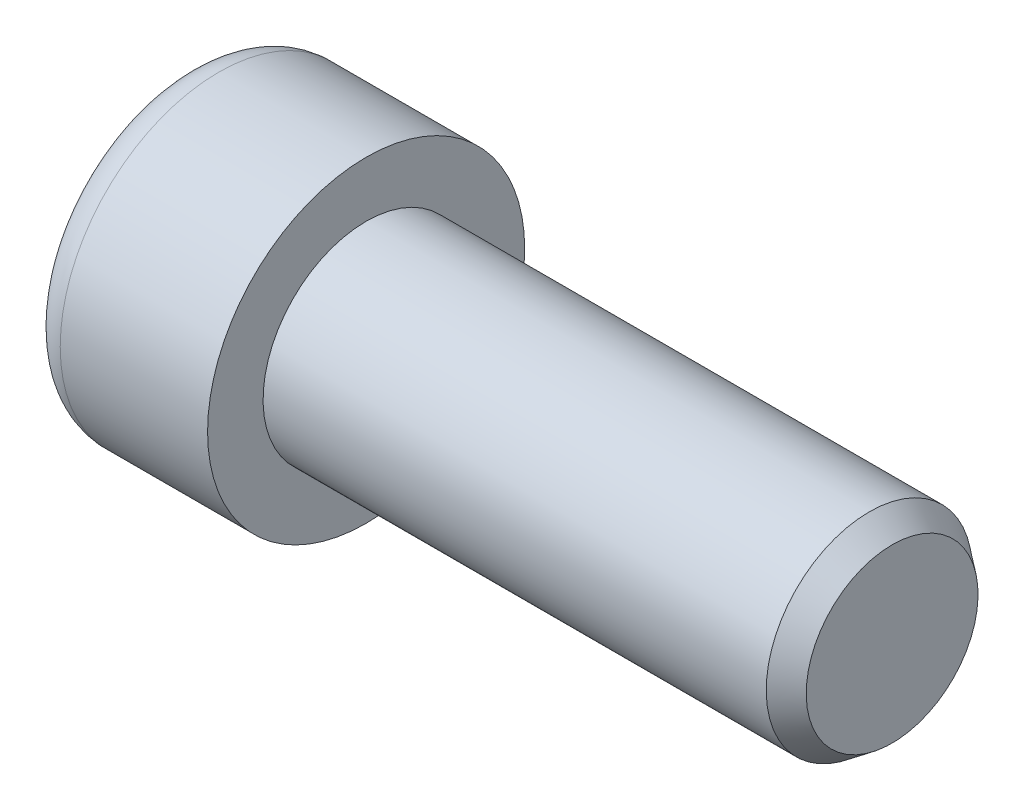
from build123d import *

# Parameters (mm, degrees)
ENL_V_MAT_EXTRU_1_DEPTH = 3
CONG_1_R                = 1


with BuildPart() as part:
    # Esquisse1 → R_volution1 (revolve)
    with BuildSketch(Plane(origin=(0, 331.163762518, 486.544521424), x_dir=(1, 0, 0), z_dir=(-2.1801348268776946e-15, -0.26285670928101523, -0.9648348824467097)), mode=Mode.PRIVATE) as r_volution1_sk:
        Polygon((-260.2005836, 66.110103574), (-260.2005836, 68.610660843), (-260.864838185, 69.110103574), (-275.510043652, 69.110103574), (-275.510043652, 70.725166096), (-280.798930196, 70.725166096), (-280.798930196, 66.110103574), align=None)
    revolve(r_volution1_sk.sketch.rotate(Axis((-255.510043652, 267.378428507, 503.922005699), (-1, 0, 0)), 164.760363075), axis=Axis((-255.510043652, 267.378428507, 503.922005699), (-1, 0, 0)))

    # Esquisse2 → Enl_v. mat.-Extru.1 (cut)
    with BuildSketch(Plane.ZY.offset(280.798930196)):
        Polygon((506.151783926, 267.979612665), (504.51625406, 269.610065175), (502.286475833, 269.008881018), (501.692227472, 266.777244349), (503.327757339, 265.146791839), (505.557535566, 265.747975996), align=None)
    extrude(amount=-ENL_V_MAT_EXTRU_1_DEPTH, mode=Mode.SUBTRACT)

    # Cong_1
    cong_1_edges = [part.edges().sort_by_distance(p)[0] for p in [
        (-280.798930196, 262.763365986, 503.922005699),
    ]]
    fillet(cong_1_edges, radius=CONG_1_R)


solid = part.part
